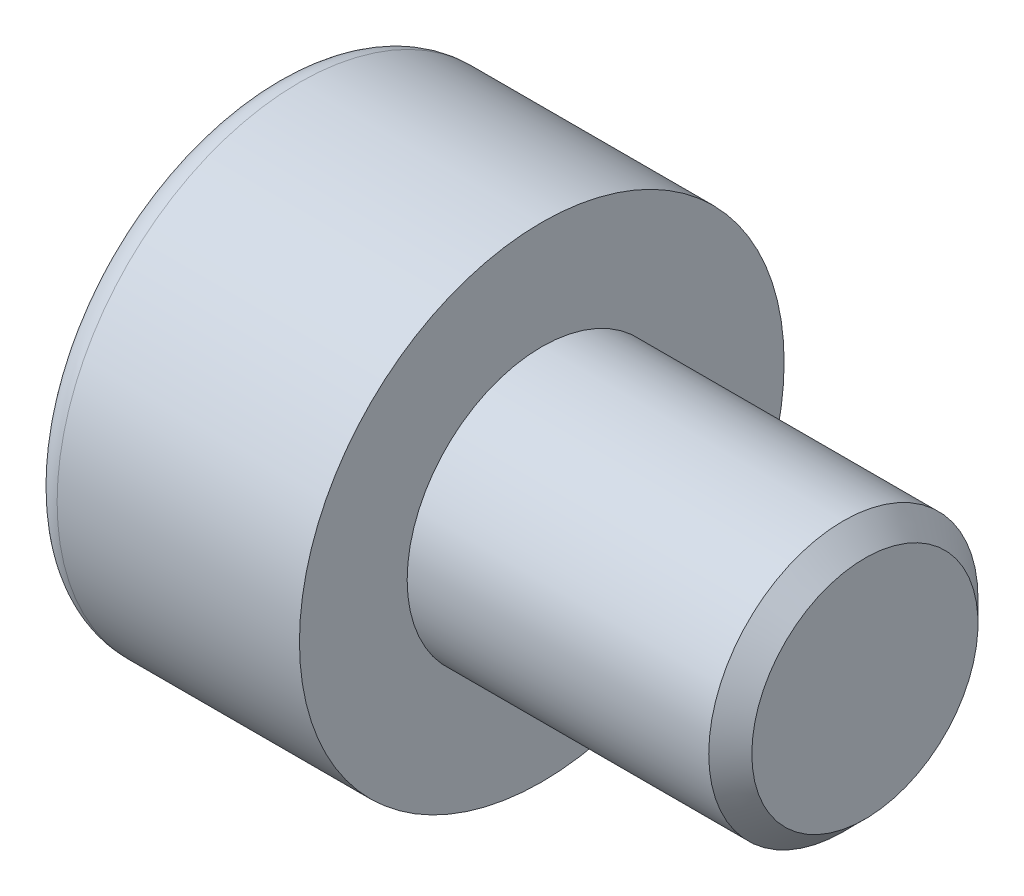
ISO-10303-21;
HEADER;
FILE_DESCRIPTION(('STEP AP214'),'2;1');
FILE_NAME('part.step','',(''),(''),'','','');
FILE_SCHEMA(('AUTOMOTIVE_DESIGN { 1 0 10303 214 1 1 1 1 }'));
ENDSEC;
DATA;
#1=APPLICATION_CONTEXT('core data for automotive mechanical design processes');
#2=APPLICATION_PROTOCOL_DEFINITION('international standard','automotive_design',2000,#1);
#3=PRODUCT_CONTEXT('',#1,'mechanical');
#4=PRODUCT('Part','Part','',(#3));
#5=PRODUCT_RELATED_PRODUCT_CATEGORY('part','',(#4));
#6=PRODUCT_DEFINITION_FORMATION('','',#4);
#7=PRODUCT_DEFINITION_CONTEXT('part definition',#1,'design');
#8=PRODUCT_DEFINITION('design','',#6,#7);
#9=PRODUCT_DEFINITION_SHAPE('','',#8);
#10=(LENGTH_UNIT() NAMED_UNIT(*) SI_UNIT(.MILLI.,.METRE.));
#11=(NAMED_UNIT(*) PLANE_ANGLE_UNIT() SI_UNIT($,.RADIAN.));
#12=(NAMED_UNIT(*) SI_UNIT($,.STERADIAN.) SOLID_ANGLE_UNIT());
#13=UNCERTAINTY_MEASURE_WITH_UNIT(LENGTH_MEASURE(1.E-05),#10,'distance_accuracy_value','');
#14=(GEOMETRIC_REPRESENTATION_CONTEXT(3) GLOBAL_UNCERTAINTY_ASSIGNED_CONTEXT((#13)) GLOBAL_UNIT_ASSIGNED_CONTEXT((#10,
#11,#12)) REPRESENTATION_CONTEXT('',''));
#15=CARTESIAN_POINT('',(0.,0.,0.));
#16=DIRECTION('',(0.,0.,1.));
#17=DIRECTION('',(1.,0.,0.));
#18=AXIS2_PLACEMENT_3D('',#15,#16,#17);
#19=CARTESIAN_POINT('',(-0.850000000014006,0.,0.));
#20=DIRECTION('',(-1.,0.,0.));
#21=DIRECTION('',(0.,0.,1.));
#22=AXIS2_PLACEMENT_3D('',#19,#20,#21);
#23=CONICAL_SURFACE('',#22,0.952380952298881,1.04719755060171);
#24=CARTESIAN_POINT('',(-0.300142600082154,-5.6843418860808E-11,0.));
#25=VERTEX_POINT('',#24);
#26=VERTEX_LOOP('',#25);
#27=FACE_BOUND('',#26,.T.);
#28=CARTESIAN_POINT('',(-0.850000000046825,0.,0.));
#29=DIRECTION('',(-1.,0.,0.));
#30=DIRECTION('',(0.,0.,1.));
#31=AXIS2_PLACEMENT_3D('',#28,#29,#30);
#32=CIRCLE('',#31,0.952380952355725);
#33=CARTESIAN_POINT('',(-0.850000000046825,0.,0.952380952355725));
#34=VERTEX_POINT('',#33);
#35=EDGE_CURVE('E22',#34,#34,#32,.T.);
#36=ORIENTED_EDGE('',*,*,#35,.T.);
#37=EDGE_LOOP('',(#36));
#38=FACE_BOUND('',#37,.T.);
#39=ADVANCED_FACE('F17',(#27,#38),#23,.F.);
#40=CARTESIAN_POINT('',(-0.85,0.,0.));
#41=DIRECTION('',(1.,0.,0.));
#42=DIRECTION('',(0.,0.,-1.));
#43=AXIS2_PLACEMENT_3D('',#40,#41,#42);
#44=PLANE('',#43);
#45=ORIENTED_EDGE('',*,*,#35,.F.);
#46=EDGE_LOOP('',(#45));
#47=FACE_BOUND('',#46,.T.);
#48=DIRECTION('',(0.,0.5,-0.866025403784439));
#49=VECTOR('',#48,1.);
#50=CARTESIAN_POINT('',(-0.85,-1.14892703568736,0.));
#51=LINE('',#50,#49);
#52=CARTESIAN_POINT('',(-0.85,-0.57446350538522,-0.995000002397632));
#53=VERTEX_POINT('',#52);
#54=CARTESIAN_POINT('',(-0.85,-1.14892703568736,0.));
#55=VERTEX_POINT('',#54);
#56=EDGE_CURVE('E313',#53,#55,#51,.F.);
#57=ORIENTED_EDGE('',*,*,#56,.T.);
#58=DIRECTION('',(0.,-0.5,-0.866025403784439));
#59=VECTOR('',#58,1.);
#60=CARTESIAN_POINT('',(-0.85,-0.574463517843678,0.995));
#61=LINE('',#60,#59);
#62=CARTESIAN_POINT('',(-0.85,-0.574463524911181,0.994999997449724));
#63=VERTEX_POINT('',#62);
#64=EDGE_CURVE('E317',#55,#63,#61,.F.);
#65=ORIENTED_EDGE('',*,*,#64,.T.);
#66=DIRECTION('',(0.,1.,0.));
#67=VECTOR('',#66,1.);
#68=CARTESIAN_POINT('',(-0.85,0.574463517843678,0.995));
#69=LINE('',#68,#67);
#70=CARTESIAN_POINT('',(-0.85,0.574463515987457,0.995000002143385));
#71=VERTEX_POINT('',#70);
#72=EDGE_CURVE('E84',#63,#71,#69,.T.);
#73=ORIENTED_EDGE('',*,*,#72,.T.);
#74=DIRECTION('',(0.,-0.5,0.866025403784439));
#75=VECTOR('',#74,1.);
#76=CARTESIAN_POINT('',(-0.85,1.14892703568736,0.));
#77=LINE('',#76,#75);
#78=CARTESIAN_POINT('',(-0.85,1.14892703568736,0.));
#79=VERTEX_POINT('',#78);
#80=EDGE_CURVE('E91',#71,#79,#77,.F.);
#81=ORIENTED_EDGE('',*,*,#80,.T.);
#82=DIRECTION('',(0.,0.5,0.866025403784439));
#83=VECTOR('',#82,1.);
#84=CARTESIAN_POINT('',(-0.85,0.574463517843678,-0.995));
#85=LINE('',#84,#83);
#86=CARTESIAN_POINT('',(-0.85,0.574463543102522,-0.994999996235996));
#87=VERTEX_POINT('',#86);
#88=EDGE_CURVE('E304',#79,#87,#85,.F.);
#89=ORIENTED_EDGE('',*,*,#88,.T.);
#90=DIRECTION('',(0.,1.,0.));
#91=VECTOR('',#90,1.);
#92=CARTESIAN_POINT('',(-0.85,-0.574463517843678,-0.995));
#93=LINE('',#92,#91);
#94=EDGE_CURVE('E279',#87,#53,#93,.F.);
#95=ORIENTED_EDGE('',*,*,#94,.T.);
#96=EDGE_LOOP('',(#57,#65,#73,#81,#89,#95));
#97=FACE_BOUND('',#96,.T.);
#98=ADVANCED_FACE('F148',(#47,#97),#44,.F.);
#99=CARTESIAN_POINT('',(-0.85,0.574463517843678,0.995));
#100=DIRECTION('',(0.,0.,1.));
#101=DIRECTION('',(1.,0.,0.));
#102=AXIS2_PLACEMENT_3D('',#99,#100,#101);
#103=PLANE('',#102);
#104=CARTESIAN_POINT('',(-2.34499999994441,0.,0.995));
#105=CARTESIAN_POINT('',(-2.3449743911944,-0.0305677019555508,0.995));
#106=CARTESIAN_POINT('',(-2.34640800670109,-0.0611198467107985,0.995));
#107=CARTESIAN_POINT('',(-2.35199243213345,-0.121922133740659,0.995));
#108=CARTESIAN_POINT('',(-2.3561383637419,-0.152172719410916,0.995));
#109=CARTESIAN_POINT('',(-2.3668659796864,-0.211759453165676,0.995));
#110=CARTESIAN_POINT('',(-2.37340998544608,-0.241102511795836,0.995));
#111=CARTESIAN_POINT('',(-2.38864217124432,-0.299229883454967,0.995));
#112=CARTESIAN_POINT('',(-2.39733102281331,-0.328014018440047,0.995));
#113=CARTESIAN_POINT('',(-2.41947932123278,-0.393688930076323,0.995));
#114=CARTESIAN_POINT('',(-2.43358464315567,-0.430359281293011,0.995));
#115=CARTESIAN_POINT('',(-2.46443795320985,-0.50302343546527,0.995));
#116=CARTESIAN_POINT('',(-2.48121157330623,-0.53900643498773,0.995));
#117=CARTESIAN_POINT('',(-2.49892704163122,-0.574463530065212,0.995));
#118=B_SPLINE_CURVE_WITH_KNOTS('',3,(#104,#105,#106,#107,#108,#109,#110,#111,#112,#113,#114,
#115,#116,#117),.UNSPECIFIED.,.F.,.F.,(4,2,2,2,2,2,4),(0.,0.0916446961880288,0.183125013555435,
0.273225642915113,0.36335451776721,0.481117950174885,0.600089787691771),.UNSPECIFIED.);
#119=CARTESIAN_POINT('',(-2.34499999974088,0.,0.994999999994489));
#120=VERTEX_POINT('',#119);
#121=CARTESIAN_POINT('',(-2.49892703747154,-0.574463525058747,0.994999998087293));
#122=VERTEX_POINT('',#121);
#123=EDGE_CURVE('E79',#120,#122,#118,.T.);
#124=ORIENTED_EDGE('',*,*,#123,.F.);
#125=CARTESIAN_POINT('',(-2.49892703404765,0.574463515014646,0.995));
#126=CARTESIAN_POINT('',(-2.47907510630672,0.534722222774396,0.995));
#127=CARTESIAN_POINT('',(-2.46039599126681,0.49430925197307,0.995));
#128=CARTESIAN_POINT('',(-2.42621425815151,0.411872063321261,0.995));
#129=CARTESIAN_POINT('',(-2.41073261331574,0.36983922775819,0.995));
#130=CARTESIAN_POINT('',(-2.38444123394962,0.285641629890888,0.995));
#131=CARTESIAN_POINT('',(-2.37350879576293,0.243516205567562,0.995));
#132=CARTESIAN_POINT('',(-2.35666503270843,0.15836168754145,0.995));
#133=CARTESIAN_POINT('',(-2.35073836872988,0.115335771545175,0.995));
#134=CARTESIAN_POINT('',(-2.34674431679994,0.0601561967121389,0.995));
#135=CARTESIAN_POINT('',(-2.34609249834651,0.048163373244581,0.995));
#136=CARTESIAN_POINT('',(-2.34521965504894,0.0241145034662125,0.995));
#137=CARTESIAN_POINT('',(-2.34500034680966,0.0120583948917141,0.995));
#138=CARTESIAN_POINT('',(-2.34499999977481,6.10102043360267E-13,0.995));
#139=B_SPLINE_CURVE_WITH_KNOTS('',3,(#125,#126,#127,#128,#129,#130,#131,#132,#133,#134,#135,
#136,#137,#138),.UNSPECIFIED.,.F.,.F.,(4,2,2,2,2,2,4),(0.,0.133369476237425,0.267587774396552,
0.397905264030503,0.527821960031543,0.563847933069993,0.600016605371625),.UNSPECIFIED.);
#140=CARTESIAN_POINT('',(-2.49892703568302,0.574463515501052,0.995000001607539));
#141=VERTEX_POINT('',#140);
#142=EDGE_CURVE('E72',#141,#120,#139,.T.);
#143=ORIENTED_EDGE('',*,*,#142,.F.);
#144=DIRECTION('',(1.,0.,0.));
#145=VECTOR('',#144,1.);
#146=CARTESIAN_POINT('',(-0.85,0.574463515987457,0.995000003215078));
#147=LINE('',#146,#145);
#148=EDGE_CURVE('E76',#141,#71,#147,.T.);
#149=ORIENTED_EDGE('',*,*,#148,.T.);
#150=ORIENTED_EDGE('',*,*,#72,.F.);
#151=DIRECTION('',(1.,0.,0.));
#152=VECTOR('',#151,1.);
#153=CARTESIAN_POINT('',(-0.85,-0.574463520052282,0.994999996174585));
#154=LINE('',#153,#152);
#155=EDGE_CURVE('E315',#63,#122,#154,.F.);
#156=ORIENTED_EDGE('',*,*,#155,.T.);
#157=EDGE_LOOP('',(#124,#143,#149,#150,#156));
#158=FACE_BOUND('',#157,.T.);
#159=ADVANCED_FACE('F74',(#158),#103,.F.);
#160=CARTESIAN_POINT('',(-0.85,-0.574463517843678,0.995));
#161=DIRECTION('',(0.,-0.866025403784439,0.5));
#162=DIRECTION('',(0.,-0.5,-0.866025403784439));
#163=AXIS2_PLACEMENT_3D('',#160,#161,#162);
#164=PLANE('',#163);
#165=CARTESIAN_POINT('',(-2.49913739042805,-1.14913733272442,-0.00036424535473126));
#166=CARTESIAN_POINT('',(-2.47938857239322,-1.12938020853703,0.0338560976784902));
#167=CARTESIAN_POINT('',(-2.46079873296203,-1.10929266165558,0.0686487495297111));
#168=CARTESIAN_POINT('',(-2.42675971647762,-1.0683313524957,0.13959581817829));
#169=CARTESIAN_POINT('',(-2.4113295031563,-1.04745368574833,0.175756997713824));
#170=CARTESIAN_POINT('',(-2.38489633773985,-1.00535430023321,0.248675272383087));
#171=CARTESIAN_POINT('',(-2.37382694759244,-0.98414331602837,0.285413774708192));
#172=CARTESIAN_POINT('',(-2.35677080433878,-0.94125421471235,0.35969987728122));
#173=CARTESIAN_POINT('',(-2.35077130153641,-0.91957741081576,0.397245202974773));
#174=CARTESIAN_POINT('',(-2.34536065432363,-0.8822249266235,0.461941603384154));
#175=CARTESIAN_POINT('',(-2.34455998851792,-0.866597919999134,0.489008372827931));
#176=CARTESIAN_POINT('',(-2.34590101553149,-0.835374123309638,0.543089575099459));
#177=CARTESIAN_POINT('',(-2.34804335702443,-0.819777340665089,0.570103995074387));
#178=CARTESIAN_POINT('',(-2.35874331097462,-0.773209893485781,0.650761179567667));
#179=CARTESIAN_POINT('',(-2.37157503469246,-0.742470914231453,0.704002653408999));
#180=CARTESIAN_POINT('',(-2.40253293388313,-0.688539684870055,0.797414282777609));
#181=CARTESIAN_POINT('',(-2.41903118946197,-0.66509374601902,0.838023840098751));
#182=CARTESIAN_POINT('',(-2.45619453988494,-0.619119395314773,0.91765375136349));
#183=CARTESIAN_POINT('',(-2.47684610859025,-0.596588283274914,0.956678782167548));
#184=CARTESIAN_POINT('',(-2.49892703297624,-0.574463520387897,0.994999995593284));
#185=B_SPLINE_CURVE_WITH_KNOTS('',3,(#165,#166,#167,#168,#169,#170,#171,#172,#173,#174,#175,
#176,#177,#178,#179,#180,#181,#182,#183,#184),.UNSPECIFIED.,.F.,.F.,(4,2,2,2,2,2,2,2,2,4),(0.,
0.132615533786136,0.266005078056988,0.397275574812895,0.528214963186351,0.621871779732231,
0.715549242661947,0.902956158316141,1.0518860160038,1.20033848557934),.UNSPECIFIED.);
#186=CARTESIAN_POINT('',(-2.49967441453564,-1.14925495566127,1.37088865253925E-05));
#187=VERTEX_POINT('',#186);
#188=EDGE_CURVE('E92',#187,#122,#185,.T.);
#189=ORIENTED_EDGE('',*,*,#188,.T.);
#190=ORIENTED_EDGE('',*,*,#155,.F.);
#191=ORIENTED_EDGE('',*,*,#64,.F.);
#192=DIRECTION('',(-1.,0.,0.));
#193=VECTOR('',#192,1.);
#194=CARTESIAN_POINT('',(-0.85,-1.14892703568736,0.));
#195=LINE('',#194,#193);
#196=EDGE_CURVE('E307',#55,#187,#195,.T.);
#197=ORIENTED_EDGE('',*,*,#196,.T.);
#198=EDGE_LOOP('',(#189,#190,#191,#197));
#199=FACE_BOUND('',#198,.T.);
#200=ADVANCED_FACE('F147',(#199),#164,.F.);
#201=CARTESIAN_POINT('',(-0.85,-1.14892703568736,0.));
#202=DIRECTION('',(0.,-0.866025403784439,-0.5));
#203=DIRECTION('',(0.,0.5,-0.866025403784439));
#204=AXIS2_PLACEMENT_3D('',#201,#202,#203);
#205=PLANE('',#204);
#206=CARTESIAN_POINT('',(-2.49892702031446,-0.574463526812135,-0.994999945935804));
#207=CARTESIAN_POINT('',(-2.47920125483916,-0.594208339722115,-0.960800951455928));
#208=CARTESIAN_POINT('',(-2.46063412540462,-0.614283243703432,-0.926030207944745));
#209=CARTESIAN_POINT('',(-2.42663854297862,-0.655218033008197,-0.855129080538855));
#210=CARTESIAN_POINT('',(-2.41122899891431,-0.676081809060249,-0.818991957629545));
#211=CARTESIAN_POINT('',(-2.38483285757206,-0.718152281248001,-0.746123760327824));
#212=CARTESIAN_POINT('',(-2.37377984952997,-0.739348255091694,-0.709411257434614));
#213=CARTESIAN_POINT('',(-2.35674986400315,-0.782206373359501,-0.635178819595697));
#214=CARTESIAN_POINT('',(-2.35076018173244,-0.803867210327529,-0.597661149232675));
#215=CARTESIAN_POINT('',(-2.34535763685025,-0.841202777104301,-0.532994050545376));
#216=CARTESIAN_POINT('',(-2.34455932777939,-0.856829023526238,-0.505928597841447));
#217=CARTESIAN_POINT('',(-2.34590474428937,-0.888051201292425,-0.451850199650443));
#218=CARTESIAN_POINT('',(-2.34804911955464,-0.903647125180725,-0.424837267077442));
#219=CARTESIAN_POINT('',(-2.35875462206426,-0.950212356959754,-0.344183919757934));
#220=CARTESIAN_POINT('',(-2.37158937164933,-0.980949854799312,-0.290945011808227));
#221=CARTESIAN_POINT('',(-2.40257169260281,-1.03491414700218,-0.197476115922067));
#222=CARTESIAN_POINT('',(-2.41909998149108,-1.0583933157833,-0.156809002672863));
#223=CARTESIAN_POINT('',(-2.45633304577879,-1.10443127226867,-0.0770689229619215));
#224=CARTESIAN_POINT('',(-2.47702419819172,-1.12699278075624,-0.0379912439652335));
#225=CARTESIAN_POINT('',(-2.49914689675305,-1.14914683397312,0.000380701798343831));
#226=B_SPLINE_CURVE_WITH_KNOTS('',3,(#206,#207,#208,#209,#210,#211,#212,#213,#214,#215,#216,
#217,#218,#219,#220,#221,#222,#223,#224,#225),.UNSPECIFIED.,.F.,.F.,(4,2,2,2,2,2,2,2,2,4),(0.,
0.132518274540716,0.265808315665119,0.396979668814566,0.527820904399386,0.621472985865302,
0.715145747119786,0.902546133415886,1.05169311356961,1.20035972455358),.UNSPECIFIED.);
#227=CARTESIAN_POINT('',(-2.49892702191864,-0.57446349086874,-0.995));
#228=VERTEX_POINT('',#227);
#229=EDGE_CURVE('E245',#228,#187,#226,.T.);
#230=ORIENTED_EDGE('',*,*,#229,.T.);
#231=ORIENTED_EDGE('',*,*,#196,.F.);
#232=ORIENTED_EDGE('',*,*,#56,.F.);
#233=DIRECTION('',(-1.,0.,0.));
#234=VECTOR('',#233,1.);
#235=CARTESIAN_POINT('',(-0.85,-0.5744635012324,-0.995));
#236=LINE('',#235,#234);
#237=EDGE_CURVE('E276',#53,#228,#236,.T.);
#238=ORIENTED_EDGE('',*,*,#237,.T.);
#239=EDGE_LOOP('',(#230,#231,#232,#238));
#240=FACE_BOUND('',#239,.T.);
#241=ADVANCED_FACE('F154',(#240),#205,.F.);
#242=CARTESIAN_POINT('',(-0.85,0.574463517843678,-0.995));
#243=DIRECTION('',(0.,0.866025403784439,-0.5));
#244=DIRECTION('',(0.,0.5,0.866025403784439));
#245=AXIS2_PLACEMENT_3D('',#242,#243,#244);
#246=PLANE('',#245);
#247=CARTESIAN_POINT('',(-2.49913349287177,1.14913343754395,0.000357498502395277));
#248=CARTESIAN_POINT('',(-2.47938510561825,1.12937654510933,-0.0338624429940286));
#249=CARTESIAN_POINT('',(-2.46079569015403,1.10928923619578,-0.0686546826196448));
#250=CARTESIAN_POINT('',(-2.42675748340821,1.06832842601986,-0.139600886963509));
#251=CARTESIAN_POINT('',(-2.41132765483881,1.04745102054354,-0.17576161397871));
#252=CARTESIAN_POINT('',(-2.38489517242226,1.00535217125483,-0.24867895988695));
#253=CARTESIAN_POINT('',(-2.37382608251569,0.984141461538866,-0.285416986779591));
#254=CARTESIAN_POINT('',(-2.35677041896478,0.941252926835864,-0.359702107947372));
#255=CARTESIAN_POINT('',(-2.35077109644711,0.919576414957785,-0.397246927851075));
#256=CARTESIAN_POINT('',(-2.34536059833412,0.882224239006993,-0.461942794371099));
#257=CARTESIAN_POINT('',(-2.34455997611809,0.866597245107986,-0.489009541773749));
#258=CARTESIAN_POINT('',(-2.34590108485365,0.835373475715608,-0.543090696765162));
#259=CARTESIAN_POINT('',(-2.34804346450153,0.819776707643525,-0.570105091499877));
#260=CARTESIAN_POINT('',(-2.35874352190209,0.7732093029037,-0.650762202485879));
#261=CARTESIAN_POINT('',(-2.37157530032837,0.742470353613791,-0.704003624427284));
#262=CARTESIAN_POINT('',(-2.40253322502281,0.688539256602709,-0.797415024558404));
#263=CARTESIAN_POINT('',(-2.41903143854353,0.665093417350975,-0.8380244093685));
#264=CARTESIAN_POINT('',(-2.45619466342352,0.619119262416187,-0.917653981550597));
#265=CARTESIAN_POINT('',(-2.47684614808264,0.596588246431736,-0.956678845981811));
#266=CARTESIAN_POINT('',(-2.49892697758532,0.574463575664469,-0.994999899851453));
#267=B_SPLINE_CURVE_WITH_KNOTS('',3,(#247,#248,#249,#250,#251,#252,#253,#254,#255,#256,#257,
#258,#259,#260,#261,#262,#263,#264,#265,#266),.UNSPECIFIED.,.F.,.F.,(4,2,2,2,2,2,2,2,2,4),(0.,
0.132613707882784,0.26600138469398,0.397270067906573,0.528207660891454,0.621864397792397,
0.715541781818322,0.902948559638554,1.05187781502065,1.20032966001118),.UNSPECIFIED.);
#268=CARTESIAN_POINT('',(-2.49967445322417,1.14925510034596,-2.50553599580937E-05));
#269=VERTEX_POINT('',#268);
#270=CARTESIAN_POINT('',(-2.49892701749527,0.574463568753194,-0.994999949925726));
#271=VERTEX_POINT('',#270);
#272=EDGE_CURVE('E250',#269,#271,#267,.T.);
#273=ORIENTED_EDGE('',*,*,#272,.T.);
#274=DIRECTION('',(-1.,0.,0.));
#275=VECTOR('',#274,1.);
#276=CARTESIAN_POINT('',(-0.85,0.574463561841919,-0.995));
#277=LINE('',#276,#275);
#278=EDGE_CURVE('E277',#271,#87,#277,.F.);
#279=ORIENTED_EDGE('',*,*,#278,.T.);
#280=ORIENTED_EDGE('',*,*,#88,.F.);
#281=DIRECTION('',(-1.,0.,0.));
#282=VECTOR('',#281,1.);
#283=CARTESIAN_POINT('',(-0.85,1.14892703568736,0.));
#284=LINE('',#283,#282);
#285=EDGE_CURVE('E93',#79,#269,#284,.T.);
#286=ORIENTED_EDGE('',*,*,#285,.T.);
#287=EDGE_LOOP('',(#273,#279,#280,#286));
#288=FACE_BOUND('',#287,.T.);
#289=ADVANCED_FACE('F263',(#288),#246,.F.);
#290=CARTESIAN_POINT('',(-0.85,-0.574463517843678,-0.995));
#291=DIRECTION('',(0.,0.,-1.));
#292=DIRECTION('',(-1.,0.,0.));
#293=AXIS2_PLACEMENT_3D('',#290,#291,#292);
#294=PLANE('',#293);
#295=CARTESIAN_POINT('',(-2.49892707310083,0.57446354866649,-0.994999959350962));
#296=CARTESIAN_POINT('',(-2.47920148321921,0.534974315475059,-0.994999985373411));
#297=CARTESIAN_POINT('',(-2.4606345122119,0.494824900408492,-0.994999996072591));
#298=CARTESIAN_POINT('',(-2.42663917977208,0.412956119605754,-0.995000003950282));
#299=CARTESIAN_POINT('',(-2.41122972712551,0.371228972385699,-0.995000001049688));
#300=CARTESIAN_POINT('',(-2.38483342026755,0.287088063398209,-0.994999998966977));
#301=CARTESIAN_POINT('',(-2.37378023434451,0.244695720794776,-0.994999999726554));
#302=CARTESIAN_POINT('',(-2.35674998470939,0.158978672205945,-0.995000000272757));
#303=CARTESIAN_POINT('',(-2.35076021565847,0.11565658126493,-0.995000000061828));
#304=CARTESIAN_POINT('',(-2.34535762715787,0.0409848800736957,-0.994999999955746));
#305=CARTESIAN_POINT('',(-2.34455932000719,0.00973223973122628,-0.99499999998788));
#306=CARTESIAN_POINT('',(-2.34590476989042,-0.0527124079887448,-0.995000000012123));
#307=CARTESIAN_POINT('',(-2.34804917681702,-0.0839044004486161,-0.995000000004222));
#308=CARTESIAN_POINT('',(-2.35875473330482,-0.17703472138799,-0.994999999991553));
#309=CARTESIAN_POINT('',(-2.37158942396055,-0.238509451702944,-0.994999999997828));
#310=CARTESIAN_POINT('',(-2.40254901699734,-0.346358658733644,-0.995000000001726));
#311=CARTESIAN_POINT('',(-2.41904542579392,-0.393240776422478,-0.995000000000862));
#312=CARTESIAN_POINT('',(-2.45620299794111,-0.48517024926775,-0.994999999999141));
#313=CARTESIAN_POINT('',(-2.47685060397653,-0.530223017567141,-0.994999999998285));
#314=CARTESIAN_POINT('',(-2.49892701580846,-0.574463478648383,-0.995));
#315=B_SPLINE_CURVE_WITH_KNOTS('',3,(#295,#296,#297,#298,#299,#300,#301,#302,#303,#304,#305,
#306,#307,#308,#309,#310,#311,#312,#313,#314),.UNSPECIFIED.,.F.,.F.,(4,2,2,2,2,2,2,2,2,4),(0.,
0.13251703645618,0.26580584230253,0.396978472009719,0.527820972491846,0.621473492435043,
0.71514669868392,0.902546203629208,1.05144676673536,1.19986871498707),.UNSPECIFIED.);
#316=EDGE_CURVE('E106',#271,#228,#315,.T.);
#317=ORIENTED_EDGE('',*,*,#316,.T.);
#318=ORIENTED_EDGE('',*,*,#237,.F.);
#319=ORIENTED_EDGE('',*,*,#94,.F.);
#320=ORIENTED_EDGE('',*,*,#278,.F.);
#321=EDGE_LOOP('',(#317,#318,#319,#320));
#322=FACE_BOUND('',#321,.T.);
#323=ADVANCED_FACE('F180',(#322),#294,.F.);
#324=CARTESIAN_POINT('',(-0.85,1.14892703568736,0.));
#325=DIRECTION('',(0.,0.866025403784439,0.5));
#326=DIRECTION('',(0.,-0.5,0.866025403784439));
#327=AXIS2_PLACEMENT_3D('',#324,#325,#326);
#328=PLANE('',#327);
#329=CARTESIAN_POINT('',(-2.49892703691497,0.574463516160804,0.995000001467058));
#330=CARTESIAN_POINT('',(-2.47920127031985,0.594208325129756,0.960800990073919));
#331=CARTESIAN_POINT('',(-2.46063413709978,0.61428323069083,0.926030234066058));
#332=CARTESIAN_POINT('',(-2.42663854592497,0.655218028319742,0.855129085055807));
#333=CARTESIAN_POINT('',(-2.41122899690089,0.676081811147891,0.818991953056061));
#334=CARTESIAN_POINT('',(-2.38483285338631,0.71815228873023,0.746123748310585));
#335=CARTESIAN_POINT('',(-2.37377984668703,0.739348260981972,0.709411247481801));
#336=CARTESIAN_POINT('',(-2.35674986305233,0.782206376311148,0.635178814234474));
#337=CARTESIAN_POINT('',(-2.35076018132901,0.803867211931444,0.597661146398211));
#338=CARTESIAN_POINT('',(-2.34535763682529,0.841202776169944,0.5329940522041));
#339=CARTESIAN_POINT('',(-2.34455932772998,0.856829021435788,0.50592860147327));
#340=CARTESIAN_POINT('',(-2.34590474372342,0.888051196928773,0.451850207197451));
#341=CARTESIAN_POINT('',(-2.3480491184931,0.903647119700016,0.424837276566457));
#342=CARTESIAN_POINT('',(-2.35875462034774,0.950212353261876,0.344183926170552));
#343=CARTESIAN_POINT('',(-2.37158937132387,0.98094985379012,0.290945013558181));
#344=CARTESIAN_POINT('',(-2.40257210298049,1.03491486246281,0.197474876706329));
#345=CARTESIAN_POINT('',(-2.41910096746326,1.05839471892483,0.156806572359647));
#346=CARTESIAN_POINT('',(-2.45633539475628,1.10443399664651,0.0770642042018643));
#347=CARTESIAN_POINT('',(-2.47702733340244,1.12699613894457,0.0379854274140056));
#348=CARTESIAN_POINT('',(-2.49915086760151,1.14915080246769,-0.000387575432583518));
#349=B_SPLINE_CURVE_WITH_KNOTS('',3,(#329,#330,#331,#332,#333,#334,#335,#336,#337,#338,#339,
#340,#341,#342,#343,#344,#345,#346,#347,#348),.UNSPECIFIED.,.F.,.F.,(4,2,2,2,2,2,2,2,2,4),(0.,
0.132518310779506,0.26580838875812,0.396979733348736,0.52782096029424,0.621473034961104,
0.715145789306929,0.90254619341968,1.05169762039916,1.20036864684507),.UNSPECIFIED.);
#350=EDGE_CURVE('E89',#141,#269,#349,.T.);
#351=ORIENTED_EDGE('',*,*,#350,.T.);
#352=ORIENTED_EDGE('',*,*,#285,.F.);
#353=ORIENTED_EDGE('',*,*,#80,.F.);
#354=ORIENTED_EDGE('',*,*,#148,.F.);
#355=EDGE_LOOP('',(#351,#352,#353,#354));
#356=FACE_BOUND('',#355,.T.);
#357=ADVANCED_FACE('F87',(#356),#328,.F.);
#358=CARTESIAN_POINT('',(2.99999999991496,1.5462594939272,0.));
#359=DIRECTION('',(1.,0.,0.));
#360=DIRECTION('',(0.,0.,-1.));
#361=AXIS2_PLACEMENT_3D('',#358,#359,#360);
#362=PLANE('',#361);
#363=CARTESIAN_POINT('',(2.99999999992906,0.,0.));
#364=DIRECTION('',(-1.,0.,0.));
#365=DIRECTION('',(0.,0.,1.));
#366=AXIS2_PLACEMENT_3D('',#363,#364,#365);
#367=CIRCLE('',#366,1.05000000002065);
#368=CARTESIAN_POINT('',(2.99999999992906,0.,1.05000000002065));
#369=VERTEX_POINT('',#368);
#370=EDGE_CURVE('E100',#369,#369,#367,.T.);
#371=ORIENTED_EDGE('',*,*,#370,.F.);
#372=EDGE_LOOP('',(#371));
#373=FACE_BOUND('',#372,.T.);
#374=ADVANCED_FACE('F170',(#373),#362,.T.);
#375=CARTESIAN_POINT('',(-2.50093213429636,0.,0.));
#376=DIRECTION('',(-1.,0.,0.));
#377=DIRECTION('',(0.,0.,1.));
#378=AXIS2_PLACEMENT_3D('',#375,#376,#377);
#379=CONICAL_SURFACE('',#378,1.15093213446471,0.785398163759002);
#380=CARTESIAN_POINT('',(-2.5,0.,0.));
#381=DIRECTION('',(-1.,0.,0.));
#382=DIRECTION('',(0.,0.,1.));
#383=AXIS2_PLACEMENT_3D('',#380,#381,#382);
#384=CIRCLE('',#383,1.15000000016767);
#385=CARTESIAN_POINT('',(-2.49999999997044,0.,1.15000000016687));
#386=VERTEX_POINT('',#385);
#387=EDGE_CURVE('E104',#386,#187,#384,.F.);
#388=ORIENTED_EDGE('',*,*,#387,.F.);
#389=DIRECTION('',(0.707106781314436,0.,-0.707106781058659));
#390=VECTOR('',#389,1.);
#391=CARTESIAN_POINT('',(-499000.,0.,498998.649819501));
#392=LINE('',#391,#390);
#393=EDGE_CURVE('E101',#386,#120,#392,.T.);
#394=ORIENTED_EDGE('',*,*,#393,.T.);
#395=ORIENTED_EDGE('',*,*,#123,.T.);
#396=ORIENTED_EDGE('',*,*,#188,.F.);
#397=EDGE_LOOP('',(#388,#394,#395,#396));
#398=FACE_BOUND('',#397,.T.);
#399=ADVANCED_FACE('F167',(#398),#379,.F.);
#400=CARTESIAN_POINT('',(-2.49946299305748,0.,0.));
#401=DIRECTION('',(-1.,0.,0.));
#402=DIRECTION('',(0.,0.,1.));
#403=AXIS2_PLACEMENT_3D('',#400,#401,#402);
#404=CONICAL_SURFACE('',#403,1.14946299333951,0.785398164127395);
#405=ORIENTED_EDGE('',*,*,#272,.F.);
#406=CARTESIAN_POINT('',(-2.5,0.,0.));
#407=DIRECTION('',(-1.,0.,0.));
#408=DIRECTION('',(0.,0.,1.));
#409=AXIS2_PLACEMENT_3D('',#406,#407,#408);
#410=CIRCLE('',#409,1.15000000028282);
#411=EDGE_CURVE('E229',#187,#269,#410,.F.);
#412=ORIENTED_EDGE('',*,*,#411,.F.);
#413=ORIENTED_EDGE('',*,*,#229,.F.);
#414=ORIENTED_EDGE('',*,*,#316,.F.);
#415=EDGE_LOOP('',(#405,#412,#413,#414));
#416=FACE_BOUND('',#415,.T.);
#417=ADVANCED_FACE('F129',(#416),#404,.F.);
#418=CARTESIAN_POINT('',(-2.5009317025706,0.,0.));
#419=DIRECTION('',(-1.,0.,0.));
#420=DIRECTION('',(0.,0.,1.));
#421=AXIS2_PLACEMENT_3D('',#418,#419,#420);
#422=CONICAL_SURFACE('',#421,1.15093170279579,0.785398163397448);
#423=ORIENTED_EDGE('',*,*,#350,.F.);
#424=ORIENTED_EDGE('',*,*,#142,.T.);
#425=ORIENTED_EDGE('',*,*,#393,.F.);
#426=CARTESIAN_POINT('',(-2.5,0.,0.));
#427=DIRECTION('',(-1.,0.,0.));
#428=DIRECTION('',(0.,0.,1.));
#429=AXIS2_PLACEMENT_3D('',#426,#427,#428);
#430=CIRCLE('',#429,1.15000000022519);
#431=EDGE_CURVE('E98',#269,#386,#430,.F.);
#432=ORIENTED_EDGE('',*,*,#431,.F.);
#433=EDGE_LOOP('',(#423,#424,#425,#432));
#434=FACE_BOUND('',#433,.T.);
#435=ADVANCED_FACE('F96',(#434),#422,.F.);
#436=CARTESIAN_POINT('',(2.79999999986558,0.,0.));
#437=DIRECTION('',(-1.,0.,0.));
#438=DIRECTION('',(0.,0.,1.));
#439=AXIS2_PLACEMENT_3D('',#436,#437,#438);
#440=CONICAL_SURFACE('',#439,1.25000000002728,0.78539816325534);
#441=ORIENTED_EDGE('',*,*,#370,.T.);
#442=EDGE_LOOP('',(#441));
#443=FACE_BOUND('',#442,.T.);
#444=CARTESIAN_POINT('',(2.79999999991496,0.,0.));
#445=DIRECTION('',(1.,0.,0.));
#446=DIRECTION('',(0.,0.,-1.));
#447=AXIS2_PLACEMENT_3D('',#444,#445,#446);
#448=CIRCLE('',#447,1.25);
#449=CARTESIAN_POINT('',(2.79999999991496,0.,-1.25));
#450=VERTEX_POINT('',#449);
#451=EDGE_CURVE('E201',#450,#450,#448,.F.);
#452=ORIENTED_EDGE('',*,*,#451,.F.);
#453=EDGE_LOOP('',(#452));
#454=FACE_BOUND('',#453,.T.);
#455=ADVANCED_FACE('F128',(#443,#454),#440,.T.);
#456=CARTESIAN_POINT('',(-2.5,1.575,0.));
#457=DIRECTION('',(-1.,0.,0.));
#458=DIRECTION('',(0.,0.,1.));
#459=AXIS2_PLACEMENT_3D('',#456,#457,#458);
#460=PLANE('',#459);
#461=ORIENTED_EDGE('',*,*,#411,.T.);
#462=ORIENTED_EDGE('',*,*,#431,.T.);
#463=ORIENTED_EDGE('',*,*,#387,.T.);
#464=EDGE_LOOP('',(#461,#462,#463));
#465=FACE_BOUND('',#464,.T.);
#466=CARTESIAN_POINT('',(-2.5,0.,1.99999999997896));
#467=CARTESIAN_POINT('',(-2.50000000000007,-0.0213602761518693,1.99999441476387));
#468=CARTESIAN_POINT('',(-2.49999999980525,-0.0427203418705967,1.99964659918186));
#469=CARTESIAN_POINT('',(-2.49999999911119,-0.0850058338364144,1.99828072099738));
#470=CARTESIAN_POINT('',(-2.4999999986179,-0.105931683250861,1.99727573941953));
#471=CARTESIAN_POINT('',(-2.49999999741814,-0.14732977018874,1.99463547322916));
#472=CARTESIAN_POINT('',(-2.49999999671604,-0.16780282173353,1.99301299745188));
#473=CARTESIAN_POINT('',(-2.49999999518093,-0.208277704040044,1.98917779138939));
#474=CARTESIAN_POINT('',(-2.49999999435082,-0.228280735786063,1.98697757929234));
#475=CARTESIAN_POINT('',(-2.49999999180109,-0.2869478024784,1.97962724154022));
#476=CARTESIAN_POINT('',(-2.49999998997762,-0.325511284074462,1.97364625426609));
#477=CARTESIAN_POINT('',(-2.49999998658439,-0.400597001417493,1.95974219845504));
#478=CARTESIAN_POINT('',(-2.49999998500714,-0.437136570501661,1.95191200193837));
#479=CARTESIAN_POINT('',(-2.49999998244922,-0.508117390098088,1.93461016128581));
#480=CARTESIAN_POINT('',(-2.49999998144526,-0.542580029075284,1.92522630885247));
#481=CARTESIAN_POINT('',(-2.49999998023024,-0.609373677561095,1.90510517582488));
#482=CARTESIAN_POINT('',(-2.49999997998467,-0.641729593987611,1.89445048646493));
#483=CARTESIAN_POINT('',(-2.49999998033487,-0.70430210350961,1.87206087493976));
#484=CARTESIAN_POINT('',(-2.49999998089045,-0.734546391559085,1.86040330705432));
#485=CARTESIAN_POINT('',(-2.49999998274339,-0.792908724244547,1.83626519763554));
#486=CARTESIAN_POINT('',(-2.49999998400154,-0.821056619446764,1.82385678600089));
#487=CARTESIAN_POINT('',(-2.49999998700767,-0.875257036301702,1.79845747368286));
#488=CARTESIAN_POINT('',(-2.49999998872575,-0.901340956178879,1.78553353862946));
#489=CARTESIAN_POINT('',(-2.49999999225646,-0.951458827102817,1.75932646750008));
#490=CARTESIAN_POINT('',(-2.49999999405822,-0.97552516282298,1.74610523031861));
#491=CARTESIAN_POINT('',(-2.49999999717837,-1.02166493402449,1.71950950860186));
#492=CARTESIAN_POINT('',(-2.4999999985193,-1.04377121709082,1.70619198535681));
#493=CARTESIAN_POINT('',(-2.50000000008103,-1.08605666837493,1.67959251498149));
#494=CARTESIAN_POINT('',(-2.50000000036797,-1.10626867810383,1.66636274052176));
#495=CARTESIAN_POINT('',(-2.49999999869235,-1.14483826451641,1.64011061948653));
#496=CARTESIAN_POINT('',(-2.49999999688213,-1.16322820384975,1.62713583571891));
#497=CARTESIAN_POINT('',(-2.49999999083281,-1.19822860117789,1.60154977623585));
#498=CARTESIAN_POINT('',(-2.49999998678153,-1.2148706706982,1.58898159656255));
#499=CARTESIAN_POINT('',(-2.49999996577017,-1.26029768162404,1.55355457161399));
#500=CARTESIAN_POINT('',(-2.49999994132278,-1.28866620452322,1.53015601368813));
#501=CARTESIAN_POINT('',(-2.49999989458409,-1.32996111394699,1.49414084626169));
#502=CARTESIAN_POINT('',(-2.49999987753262,-1.34339577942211,1.48210030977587));
#503=CARTESIAN_POINT('',(-2.49999980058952,-1.36836778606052,1.45913822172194));
#504=CARTESIAN_POINT('',(-2.49999974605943,-1.37994004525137,1.44825484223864));
#505=CARTESIAN_POINT('',(-2.49999972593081,-1.3944580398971,1.43421990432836));
#506=CARTESIAN_POINT('',(-2.49999972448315,-1.39754467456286,1.43121361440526));
#507=CARTESIAN_POINT('',(-2.49999972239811,-1.40784842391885,1.42111055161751));
#508=CARTESIAN_POINT('',(-2.49999972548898,-1.41501988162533,1.41396715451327));
#509=CARTESIAN_POINT('',(-2.49999973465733,-1.43560517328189,1.39314830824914));
#510=CARTESIAN_POINT('',(-2.49999974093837,-1.44887796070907,1.37933302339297));
#511=CARTESIAN_POINT('',(-2.49999975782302,-1.4804187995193,1.34554263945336));
#512=CARTESIAN_POINT('',(-2.49999976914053,-1.49848605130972,1.32537992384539));
#513=CARTESIAN_POINT('',(-2.49999979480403,-1.53894678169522,1.2783380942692));
#514=CARTESIAN_POINT('',(-2.49999980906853,-1.5610615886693,1.25121811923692));
#515=CARTESIAN_POINT('',(-2.49999983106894,-1.594955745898,1.20735154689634));
#516=CARTESIAN_POINT('',(-2.49999983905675,-1.60721444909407,1.19097245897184));
#517=CARTESIAN_POINT('',(-2.49999985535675,-1.63238460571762,1.15624388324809));
#518=CARTESIAN_POINT('',(-2.49999986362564,-1.64524459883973,1.13785698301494));
#519=CARTESIAN_POINT('',(-2.49999987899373,-1.66942628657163,1.10201320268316));
#520=CARTESIAN_POINT('',(-2.49999988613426,-1.6807918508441,1.08458586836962));
#521=CARTESIAN_POINT('',(-2.49999990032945,-1.70374837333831,1.04815569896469));
#522=CARTESIAN_POINT('',(-2.4999999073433,-1.71529964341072,1.02912783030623));
#523=CARTESIAN_POINT('',(-2.49999992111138,-1.73849367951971,0.989442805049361));
#524=CARTESIAN_POINT('',(-2.4999999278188,-1.75009320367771,0.968760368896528));
#525=CARTESIAN_POINT('',(-2.49999994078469,-1.77323752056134,0.925716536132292));
#526=CARTESIAN_POINT('',(-2.49999994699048,-1.78473541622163,0.903329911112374));
#527=CARTESIAN_POINT('',(-2.49999995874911,-1.80751745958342,0.856834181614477));
#528=CARTESIAN_POINT('',(-2.49999996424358,-1.81875095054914,0.83270024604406));
#529=CARTESIAN_POINT('',(-2.49999997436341,-1.84083232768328,0.782674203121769));
#530=CARTESIAN_POINT('',(-2.49999997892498,-1.85162571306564,0.756758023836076));
#531=CARTESIAN_POINT('',(-2.49999998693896,-1.87264222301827,0.703142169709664));
#532=CARTESIAN_POINT('',(-2.49999999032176,-1.88280693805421,0.675419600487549));
#533=CARTESIAN_POINT('',(-2.49999999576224,-1.90236886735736,0.618176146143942));
#534=CARTESIAN_POINT('',(-2.49999999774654,-1.91170372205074,0.588633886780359));
#535=CARTESIAN_POINT('',(-2.49999999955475,-1.92586685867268,0.539902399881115));
#536=CARTESIAN_POINT('',(-2.49999999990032,-1.93110440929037,0.520830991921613));
#537=CARTESIAN_POINT('',(-2.50000000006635,-1.94114075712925,0.482046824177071));
#538=CARTESIAN_POINT('',(-2.49999999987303,-1.94592473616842,0.462330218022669));
#539=CARTESIAN_POINT('',(-2.49999999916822,-1.95500432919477,0.422262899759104));
#540=CARTESIAN_POINT('',(-2.49999999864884,-1.95928462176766,0.401908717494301));
#541=CARTESIAN_POINT('',(-2.49999999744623,-1.96730651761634,0.360575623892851));
#542=CARTESIAN_POINT('',(-2.49999999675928,-1.97103231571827,0.339593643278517));
#543=CARTESIAN_POINT('',(-2.49999999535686,-1.97789366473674,0.297017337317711));
#544=CARTESIAN_POINT('',(-2.49999999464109,-1.98101293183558,0.275420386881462));
#545=CARTESIAN_POINT('',(-2.49999999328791,-1.98660873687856,0.231629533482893));
#546=CARTESIAN_POINT('',(-2.49999999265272,-1.98906852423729,0.209433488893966));
#547=CARTESIAN_POINT('',(-2.49999999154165,-1.99329206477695,0.164463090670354));
#548=CARTESIAN_POINT('',(-2.49999999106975,-1.99503861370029,0.141687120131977));
#549=CARTESIAN_POINT('',(-2.49999999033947,-1.99778173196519,0.0955789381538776));
#550=CARTESIAN_POINT('',(-2.49999999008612,-1.99876065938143,0.0722456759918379));
#551=CARTESIAN_POINT('',(-2.49999998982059,-1.99991413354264,0.0250485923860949));
#552=CARTESIAN_POINT('',(-2.49999998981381,-2.00007061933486,0.00118432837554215));
#553=CARTESIAN_POINT('',(-2.4999999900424,-1.99952456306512,-0.0470452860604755));
#554=CARTESIAN_POINT('',(-2.49999999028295,-1.99880356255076,-0.0714104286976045));
#555=CARTESIAN_POINT('',(-2.4999999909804,-1.99644786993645,-0.120608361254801));
#556=CARTESIAN_POINT('',(-2.49999999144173,-1.99479434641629,-0.145440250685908));
#557=CARTESIAN_POINT('',(-2.49999999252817,-1.9905191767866,-0.195534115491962));
#558=CARTESIAN_POINT('',(-2.49999999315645,-1.98787835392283,-0.220794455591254));
#559=CARTESIAN_POINT('',(-2.49999999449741,-1.98157466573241,-0.271703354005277));
#560=CARTESIAN_POINT('',(-2.49999999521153,-1.97789230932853,-0.297349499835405));
#561=CARTESIAN_POINT('',(-2.49999999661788,-1.96945241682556,-0.348983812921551));
#562=CARTESIAN_POINT('',(-2.49999999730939,-1.96467510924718,-0.374968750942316));
#563=CARTESIAN_POINT('',(-2.49999999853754,-1.95399336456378,-0.427229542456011));
#564=CARTESIAN_POINT('',(-2.49999999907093,-1.94806891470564,-0.45350130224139));
#565=CARTESIAN_POINT('',(-2.49999999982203,-1.93504212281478,-0.506281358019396));
#566=CARTESIAN_POINT('',(-2.50000000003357,-1.92791956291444,-0.532784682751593));
#567=CARTESIAN_POINT('',(-2.49999999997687,-1.91650912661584,-0.572006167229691));
#568=CARTESIAN_POINT('',(-2.49999999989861,-1.91263339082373,-0.584845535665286));
#569=CARTESIAN_POINT('',(-2.4999999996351,-1.90462430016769,-0.610443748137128));
#570=CARTESIAN_POINT('',(-2.49999999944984,-1.90049094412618,-0.623202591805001));
#571=CARTESIAN_POINT('',(-2.49999999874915,-1.88770700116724,-0.661350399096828));
#572=CARTESIAN_POINT('',(-2.4999999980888,-1.8786722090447,-0.686611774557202));
#573=CARTESIAN_POINT('',(-2.49999999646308,-1.85959364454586,-0.736750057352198));
#574=CARTESIAN_POINT('',(-2.49999999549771,-1.8495498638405,-0.761626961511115));
#575=CARTESIAN_POINT('',(-2.4999999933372,-1.82846945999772,-0.810956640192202));
#576=CARTESIAN_POINT('',(-2.49999999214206,-1.81743282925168,-0.835409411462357));
#577=CARTESIAN_POINT('',(-2.49999998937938,-1.79246361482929,-0.887888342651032));
#578=CARTESIAN_POINT('',(-2.49999998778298,-1.77835493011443,-0.915830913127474));
#579=CARTESIAN_POINT('',(-2.4999999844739,-1.7488415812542,-0.971022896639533));
#580=CARTESIAN_POINT('',(-2.49999998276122,-1.73343690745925,-0.998272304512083));
#581=CARTESIAN_POINT('',(-2.49999997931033,-1.70136535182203,-1.0520182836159));
#582=CARTESIAN_POINT('',(-2.49999997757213,-1.68469846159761,-1.07851484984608));
#583=CARTESIAN_POINT('',(-2.49999997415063,-1.65013925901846,-1.1306965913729));
#584=CARTESIAN_POINT('',(-2.49999997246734,-1.63224693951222,-1.15638176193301));
#585=CARTESIAN_POINT('',(-2.49999996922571,-1.59527630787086,-1.20688409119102));
#586=CARTESIAN_POINT('',(-2.49999996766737,-1.57619798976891,-1.2317012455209));
#587=CARTESIAN_POINT('',(-2.49999996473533,-1.53689742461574,-1.28041279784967));
#588=CARTESIAN_POINT('',(-2.49999996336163,-1.51667517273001,-1.30430719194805));
#589=CARTESIAN_POINT('',(-2.49999996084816,-1.47513132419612,-1.3511205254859));
#590=CARTESIAN_POINT('',(-2.49999995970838,-1.45380972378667,-1.37403946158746));
#591=CARTESIAN_POINT('',(-2.4999999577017,-1.41011419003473,-1.41885133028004));
#592=CARTESIAN_POINT('',(-2.49999995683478,-1.38774025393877,-1.44074426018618));
#593=CARTESIAN_POINT('',(-2.49999995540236,-1.34198938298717,-1.48345583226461));
#594=CARTESIAN_POINT('',(-2.49999995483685,-1.31861244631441,-1.50427447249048));
#595=CARTESIAN_POINT('',(-2.49999995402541,-1.27090712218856,-1.54479155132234));
#596=CARTESIAN_POINT('',(-2.49999995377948,-1.24657873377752,-1.56448998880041));
#597=CARTESIAN_POINT('',(-2.499999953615,-1.19702415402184,-1.60272322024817));
#598=CARTESIAN_POINT('',(-2.49999995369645,-1.17179796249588,-1.62125801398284));
#599=CARTESIAN_POINT('',(-2.49999995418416,-1.12050340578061,-1.65712308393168));
#600=CARTESIAN_POINT('',(-2.49999995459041,-1.0944350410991,-1.67445336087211));
#601=CARTESIAN_POINT('',(-2.49999995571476,-1.04151362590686,-1.7078711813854));
#602=CARTESIAN_POINT('',(-2.49999995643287,-1.01466057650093,-1.72395872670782));
#603=CARTESIAN_POINT('',(-2.4999999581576,-0.960229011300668,-1.7548556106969));
#604=CARTESIAN_POINT('',(-2.49999995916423,-0.932650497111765,-1.76966495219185));
#605=CARTESIAN_POINT('',(-2.49999996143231,-0.876828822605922,-1.79797277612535));
#606=CARTESIAN_POINT('',(-2.49999996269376,-0.848585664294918,-1.81147126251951));
#607=CARTESIAN_POINT('',(-2.49999996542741,-0.791496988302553,-1.83712761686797));
#608=CARTESIAN_POINT('',(-2.49999996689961,-0.76265147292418,-1.84928548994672));
#609=CARTESIAN_POINT('',(-2.49999997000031,-0.70442169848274,-1.87223381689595));
#610=CARTESIAN_POINT('',(-2.4999999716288,-0.67503744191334,-1.88302427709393));
#611=CARTESIAN_POINT('',(-2.49999997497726,-0.615794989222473,-1.90321399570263));
#612=CARTESIAN_POINT('',(-2.49999997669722,-0.585936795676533,-1.91261326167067));
#613=CARTESIAN_POINT('',(-2.49999998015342,-0.52581231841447,-1.92999987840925));
#614=CARTESIAN_POINT('',(-2.49999998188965,-0.495546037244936,-1.93798723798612));
#615=CARTESIAN_POINT('',(-2.4999999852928,-0.434672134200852,-1.95253244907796));
#616=CARTESIAN_POINT('',(-2.49999998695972,-0.404064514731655,-1.95909031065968));
#617=CARTESIAN_POINT('',(-2.49999999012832,-0.34257543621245,-1.97076207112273));
#618=CARTESIAN_POINT('',(-2.49999999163,-0.311693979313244,-1.97587598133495));
#619=CARTESIAN_POINT('',(-2.49999999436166,-0.249725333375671,-1.98464863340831));
#620=CARTESIAN_POINT('',(-2.49999999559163,-0.218638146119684,-1.98830738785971));
#621=CARTESIAN_POINT('',(-2.49999999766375,-0.156326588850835,-1.99416150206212));
#622=CARTESIAN_POINT('',(-2.4999999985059,-0.125102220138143,-1.99635687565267));
#623=CARTESIAN_POINT('',(-2.49999999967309,-0.0625851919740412,-1.99928009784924));
#624=CARTESIAN_POINT('',(-2.49999999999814,-0.0312925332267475,-2.0000079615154));
#625=CARTESIAN_POINT('',(-2.5,0.,-1.99999999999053));
#626=B_SPLINE_CURVE_WITH_KNOTS('',3,(#466,#467,#468,#469,#470,#471,#472,#473,#474,#475,#476,
#477,#478,#479,#480,#481,#482,#483,#484,#485,#486,#487,#488,#489,#490,#491,#492,#493,#494,#495,
#496,#497,#498,#499,#500,#501,#502,#503,#504,#505,#506,#507,#508,#509,#510,#511,#512,#513,#514,
#515,#516,#517,#518,#519,#520,#521,#522,#523,#524,#525,#526,#527,#528,#529,#530,#531,#532,#533,
#534,#535,#536,#537,#538,#539,#540,#541,#542,#543,#544,#545,#546,#547,#548,#549,#550,#551,#552,
#553,#554,#555,#556,#557,#558,#559,#560,#561,#562,#563,#564,#565,#566,#567,#568,#569,#570,#571,
#572,#573,#574,#575,#576,#577,#578,#579,#580,#581,#582,#583,#584,#585,#586,#587,#588,#589,#590,
#591,#592,#593,#594,#595,#596,#597,#598,#599,#600,#601,#602,#603,#604,#605,#606,#607,#608,#609,
#610,#611,#612,#613,#614,#615,#616,#617,#618,#619,#620,#621,#622,#623,#624,#625),.UNSPECIFIED.,
.F.,.F.,(4,2,2,2,2,2,2,2,2,2,2,2,2,2,2,2,2,2,2,2,2,2,2,2,2,2,2,2,2,2,2,2,2,2,2,2,2,2,2,2,2,2,2,
2,2,2,2,2,2,2,2,2,2,2,2,2,2,2,2,2,2,2,2,2,2,2,2,2,2,2,2,2,2,2,2,2,2,2,2,4),(0.,
0.0640778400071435,0.126917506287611,0.188519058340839,0.248882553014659,0.365883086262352,
0.477933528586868,0.585034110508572,0.687185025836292,0.784386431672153,0.876638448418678,
0.963941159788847,1.0462946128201,1.1236988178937,1.19615374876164,1.26365934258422,
1.32621549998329,1.43646862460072,1.4905863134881,1.53823851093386,1.55116460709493,
1.5815298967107,1.63899573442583,1.72019416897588,1.82512136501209,1.88648887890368,
1.95378889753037,2.01619704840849,2.08296344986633,2.15408785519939,2.22957000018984,
2.30940960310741,2.39360636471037,2.48215996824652,2.57507007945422,2.63439494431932,
2.69525139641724,2.75763947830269,2.82155923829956,2.88701073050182,2.95399401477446,
3.02250915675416,3.09255622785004,3.16413530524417,3.23724647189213,3.31188981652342,
3.38806543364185,3.46577342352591,3.54501389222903,3.62578695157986,3.70809271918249,
3.74832517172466,3.78855780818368,3.86901953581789,3.94948192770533,4.02994493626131,
4.12381687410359,4.21768951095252,4.31156277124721,4.4054365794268,4.4993108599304,
4.59318553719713,4.68706053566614,4.78093577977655,4.8748111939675,4.96868670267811,
5.06256223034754,5.15643770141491,5.25031304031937,5.34418817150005,5.43806301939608,
5.53193750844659,5.62581156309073,5.7196851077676,5.81355806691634,5.90743036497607,
6.00130192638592,6.09517267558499,6.18904253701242,6.28291143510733),.UNSPECIFIED.);
#627=CARTESIAN_POINT('',(-2.5,-1.1830350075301E-07,1.99999999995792));
#628=VERTEX_POINT('',#627);
#629=CARTESIAN_POINT('',(-2.5,-9.4650337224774E-08,-2.00000000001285));
#630=VERTEX_POINT('',#629);
#631=EDGE_CURVE('E37',#628,#630,#626,.T.);
#632=ORIENTED_EDGE('',*,*,#631,.F.);
#633=CARTESIAN_POINT('',(-2.5,2.,0.));
#634=CARTESIAN_POINT('',(-2.49999997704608,2.00000503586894,0.0359554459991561));
#635=CARTESIAN_POINT('',(-2.49999999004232,1.99903171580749,0.0719036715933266));
#636=CARTESIAN_POINT('',(-2.50000000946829,1.99517573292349,0.143697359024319));
#637=CARTESIAN_POINT('',(-2.50000001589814,1.99229310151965,0.179542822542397));
#638=CARTESIAN_POINT('',(-2.49999993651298,1.98390324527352,0.258192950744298));
#639=CARTESIAN_POINT('',(-2.49999983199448,1.97798644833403,0.300955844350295));
#640=CARTESIAN_POINT('',(-2.49999980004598,1.96879127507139,0.35389649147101));
#641=CARTESIAN_POINT('',(-2.4999997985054,1.96688935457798,0.364321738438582));
#642=CARTESIAN_POINT('',(-2.49999980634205,1.95924552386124,0.404358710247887));
#643=CARTESIAN_POINT('',(-2.49999984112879,1.9528972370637,0.43385608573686));
#644=CARTESIAN_POINT('',(-2.49999991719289,1.93450389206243,0.510816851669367));
#645=CARTESIAN_POINT('',(-2.49999994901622,1.92137345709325,0.558026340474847));
#646=CARTESIAN_POINT('',(-2.49999998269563,1.89899081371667,0.628356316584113));
#647=CARTESIAN_POINT('',(-2.49999999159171,1.89101291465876,0.651891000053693));
#648=CARTESIAN_POINT('',(-2.50000000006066,1.87477366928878,0.697028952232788));
#649=CARTESIAN_POINT('',(-2.50000000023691,1.86657028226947,0.718653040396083));
#650=CARTESIAN_POINT('',(-2.4999999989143,1.84371523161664,0.77592385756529));
#651=CARTESIAN_POINT('',(-2.49999999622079,1.82840965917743,0.811311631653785));
#652=CARTESIAN_POINT('',(-2.49999999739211,1.79580287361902,0.881155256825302));
#653=CARTESIAN_POINT('',(-2.50000000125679,1.77850170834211,0.915611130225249));
#654=CARTESIAN_POINT('',(-2.49999999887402,1.75109851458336,0.966508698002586));
#655=CARTESIAN_POINT('',(-2.49999999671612,1.74172165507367,0.98334441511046));
#656=CARTESIAN_POINT('',(-2.49999998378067,1.72249115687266,1.01674229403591));
#657=CARTESIAN_POINT('',(-2.49999997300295,1.71263750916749,1.03330445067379));
#658=CARTESIAN_POINT('',(-2.49999993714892,1.69044176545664,1.0694238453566));
#659=CARTESIAN_POINT('',(-2.49999990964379,1.67799615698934,1.08891753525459));
#660=CARTESIAN_POINT('',(-2.49999980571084,1.65245135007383,1.12747319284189));
#661=CARTESIAN_POINT('',(-2.49999972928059,1.63935211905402,1.14653513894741));
#662=CARTESIAN_POINT('',(-2.49999955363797,1.60784191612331,1.19067912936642));
#663=CARTESIAN_POINT('',(-2.49999945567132,1.58915858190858,1.21556724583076));
#664=CARTESIAN_POINT('',(-2.4999994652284,1.54578232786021,1.27050001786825));
#665=CARTESIAN_POINT('',(-2.49999963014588,1.52075339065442,1.30028121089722));
#666=CARTESIAN_POINT('',(-2.49999988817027,1.47923795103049,1.34659554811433));
#667=CARTESIAN_POINT('',(-2.49999998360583,1.46334078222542,1.36366137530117));
#668=CARTESIAN_POINT('',(-2.50000000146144,1.44347538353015,1.38436546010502));
#669=CARTESIAN_POINT('',(-2.50000000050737,1.43974137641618,1.38823068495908));
#670=CARTESIAN_POINT('',(-2.49999999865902,1.4272811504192,1.40104757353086));
#671=CARTESIAN_POINT('',(-2.49999999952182,1.41850114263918,1.40994723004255));
#672=CARTESIAN_POINT('',(-2.5000000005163,1.39622121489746,1.43211388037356));
#673=CARTESIAN_POINT('',(-2.50000000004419,1.38261500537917,1.44527431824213));
#674=CARTESIAN_POINT('',(-2.49999999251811,1.35035897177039,1.47561305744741));
#675=CARTESIAN_POINT('',(-2.49999998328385,1.33156520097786,1.4926384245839));
#676=CARTESIAN_POINT('',(-2.49999994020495,1.2885017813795,1.53019211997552));
#677=CARTESIAN_POINT('',(-2.49999990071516,1.26405169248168,1.55051440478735));
#678=CARTESIAN_POINT('',(-2.49999981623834,1.22408438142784,1.58215163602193));
#679=CARTESIAN_POINT('',(-2.49999977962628,1.20886545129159,1.59384558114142));
#680=CARTESIAN_POINT('',(-2.4999997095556,1.17809275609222,1.61678500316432));
#681=CARTESIAN_POINT('',(-2.49999967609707,1.16253898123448,1.62803046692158));
#682=CARTESIAN_POINT('',(-2.49999958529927,1.11539653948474,1.66108113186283));
#683=CARTESIAN_POINT('',(-2.49999953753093,1.08332434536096,1.6822025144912));
#684=CARTESIAN_POINT('',(-2.4999994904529,1.01800766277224,1.72254300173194));
#685=CARTESIAN_POINT('',(-2.49999949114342,0.98476316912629,1.74176209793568));
#686=CARTESIAN_POINT('',(-2.49999954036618,0.917212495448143,1.77823257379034));
#687=CARTESIAN_POINT('',(-2.4999995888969,0.88290634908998,1.79548401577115));
#688=CARTESIAN_POINT('',(-2.4999997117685,0.813353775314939,1.82796632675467));
#689=CARTESIAN_POINT('',(-2.49999978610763,0.778107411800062,1.8431973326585));
#690=CARTESIAN_POINT('',(-2.49999991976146,0.706782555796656,1.8715625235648));
#691=CARTESIAN_POINT('',(-2.49999997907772,0.670704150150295,1.88469692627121));
#692=CARTESIAN_POINT('',(-2.50000000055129,0.620857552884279,1.90127562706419));
#693=CARTESIAN_POINT('',(-2.50000000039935,0.607377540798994,1.90560450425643));
#694=CARTESIAN_POINT('',(-2.49999999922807,0.572041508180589,1.91655444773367));
#695=CARTESIAN_POINT('',(-2.49999999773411,0.550116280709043,1.92295399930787));
#696=CARTESIAN_POINT('',(-2.49999999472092,0.497687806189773,1.93729072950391));
#697=CARTESIAN_POINT('',(-2.49999999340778,0.467090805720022,1.94488815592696));
#698=CARTESIAN_POINT('',(-2.49999999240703,0.417778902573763,1.95590784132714));
#699=CARTESIAN_POINT('',(-2.49999999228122,0.399165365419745,1.95979078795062));
#700=CARTESIAN_POINT('',(-2.49999999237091,0.359704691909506,1.96743850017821));
#701=CARTESIAN_POINT('',(-2.499999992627,0.338845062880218,1.97113921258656));
#702=CARTESIAN_POINT('',(-2.49999999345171,0.294876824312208,1.97822242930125));
#703=CARTESIAN_POINT('',(-2.49999999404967,0.271756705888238,1.98153351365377));
#704=CARTESIAN_POINT('',(-2.4999999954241,0.223261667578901,1.98761510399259));
#705=CARTESIAN_POINT('',(-2.49999999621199,0.197876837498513,1.99030680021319));
#706=CARTESIAN_POINT('',(-2.49999999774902,0.144860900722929,1.9949050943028));
#707=CARTESIAN_POINT('',(-2.49999999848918,0.117222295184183,1.99672549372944));
#708=CARTESIAN_POINT('',(-2.49999999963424,0.0597254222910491,1.99931600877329));
#709=CARTESIAN_POINT('',(-2.50000000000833,0.0298629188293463,1.99999265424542));
#710=CARTESIAN_POINT('',(-2.5,0.,1.99999999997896));
#711=B_SPLINE_CURVE_WITH_KNOTS('',3,(#633,#634,#635,#636,#637,#638,#639,#640,#641,#642,#643,
#644,#645,#646,#647,#648,#649,#650,#651,#652,#653,#654,#655,#656,#657,#658,#659,#660,#661,#662,
#663,#664,#665,#666,#667,#668,#669,#670,#671,#672,#673,#674,#675,#676,#677,#678,#679,#680,#681,
#682,#683,#684,#685,#686,#687,#688,#689,#690,#691,#692,#693,#694,#695,#696,#697,#698,#699,#700,
#701,#702,#703,#704,#705,#706,#707,#708,#709,#710),.UNSPECIFIED.,.F.,.F.,(4,2,2,2,2,2,2,2,2,2,2,
2,2,2,2,2,2,2,2,2,2,2,2,2,2,2,2,2,2,2,2,2,2,2,2,2,2,2,4),(0.,0.107839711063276,
0.215677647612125,0.345080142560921,0.376871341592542,0.46735947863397,0.614211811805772,
0.688748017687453,0.758118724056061,0.873720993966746,0.989320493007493,1.0471265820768,
1.10493376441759,1.17430362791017,1.24367695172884,1.33700364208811,1.45362468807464,
1.52358028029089,1.53970310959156,1.57720634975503,1.63398714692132,1.71004645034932,
1.8053861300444,1.8629572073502,1.92052997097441,2.03566629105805,2.15080312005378,
2.26593630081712,2.38106167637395,2.49617508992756,2.5386474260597,2.60715486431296,
2.70169420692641,2.75873042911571,2.82227547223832,2.89232933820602,2.9688920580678,
3.05196369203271,3.14154432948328),.UNSPECIFIED.);
#712=CARTESIAN_POINT('',(-2.5,2.,0.));
#713=VERTEX_POINT('',#712);
#714=EDGE_CURVE('E212',#713,#628,#711,.T.);
#715=ORIENTED_EDGE('',*,*,#714,.F.);
#716=CARTESIAN_POINT('',(-2.5,0.,-1.99999999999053));
#717=CARTESIAN_POINT('',(-2.49999997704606,0.0359554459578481,-2.00000503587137));
#718=CARTESIAN_POINT('',(-2.49999999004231,0.0719036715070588,-1.99903171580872));
#719=CARTESIAN_POINT('',(-2.5000000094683,0.143697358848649,-1.9951757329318));
#720=CARTESIAN_POINT('',(-2.50000001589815,0.179542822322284,-1.99229310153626));
#721=CARTESIAN_POINT('',(-2.49999993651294,0.258192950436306,-1.98390324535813));
#722=CARTESIAN_POINT('',(-2.49999983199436,0.300955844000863,-1.97798644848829));
#723=CARTESIAN_POINT('',(-2.49999980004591,0.353896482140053,-1.96879127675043));
#724=CARTESIAN_POINT('',(-2.49999979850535,0.364321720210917,-1.96688935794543));
#725=CARTESIAN_POINT('',(-2.49999980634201,0.404358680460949,-1.9592455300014));
#726=CARTESIAN_POINT('',(-2.49999984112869,0.433856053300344,-1.95289724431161));
#727=CARTESIAN_POINT('',(-2.4999999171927,0.510816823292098,-1.93450389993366));
#728=CARTESIAN_POINT('',(-2.49999994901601,0.558026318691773,-1.92137346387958));
#729=CARTESIAN_POINT('',(-2.49999998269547,0.628356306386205,-1.89899081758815));
#730=CARTESIAN_POINT('',(-2.49999999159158,0.651890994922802,-1.89101291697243));
#731=CARTESIAN_POINT('',(-2.5000000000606,0.697028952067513,-1.87477366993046));
#732=CARTESIAN_POINT('',(-2.5000000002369,0.7186530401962,-1.86657028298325));
#733=CARTESIAN_POINT('',(-2.4999999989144,0.775923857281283,-1.8437152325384));
#734=CARTESIAN_POINT('',(-2.49999999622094,0.811311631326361,-1.82840966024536));
#735=CARTESIAN_POINT('',(-2.49999999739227,0.881155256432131,-1.79580287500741));
#736=CARTESIAN_POINT('',(-2.5000000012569,0.915611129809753,-1.7785017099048));
#737=CARTESIAN_POINT('',(-2.49999999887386,0.96650869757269,-1.75109851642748));
#738=CARTESIAN_POINT('',(-2.49999999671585,0.983344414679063,-1.74172165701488));
#739=CARTESIAN_POINT('',(-2.49999998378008,1.01674229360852,-1.72249115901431));
#740=CARTESIAN_POINT('',(-2.49999997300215,1.0333044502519,-1.71263751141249));
#741=CARTESIAN_POINT('',(-2.49999993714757,1.06942384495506,-1.69044176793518));
#742=CARTESIAN_POINT('',(-2.49999990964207,1.0889175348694,-1.67799615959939));
#743=CARTESIAN_POINT('',(-2.4999998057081,1.1274731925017,-1.65245135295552));
#744=CARTESIAN_POINT('',(-2.4999997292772,1.14653513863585,-1.63935212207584));
#745=CARTESIAN_POINT('',(-2.49999955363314,1.19067912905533,-1.60784191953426));
#746=CARTESIAN_POINT('',(-2.49999945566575,1.21556724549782,-1.58915858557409));
#747=CARTESIAN_POINT('',(-2.49999946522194,1.27050001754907,-1.54578233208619));
#748=CARTESIAN_POINT('',(-2.49999963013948,1.30028121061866,-1.52075339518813));
#749=CARTESIAN_POINT('',(-2.49999988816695,1.34659554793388,-1.47923795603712));
#750=CARTESIAN_POINT('',(-2.49999998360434,1.36366137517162,-1.46334078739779));
#751=CARTESIAN_POINT('',(-2.5000000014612,1.38436545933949,-1.44347538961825));
#752=CARTESIAN_POINT('',(-2.50000000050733,1.38823068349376,-1.43974138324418));
#753=CARTESIAN_POINT('',(-2.49999999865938,1.40104757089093,-1.42728115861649));
#754=CARTESIAN_POINT('',(-2.49999999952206,1.40994722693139,-1.41850115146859));
#755=CARTESIAN_POINT('',(-2.5000000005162,1.43211387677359,-1.39622122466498));
#756=CARTESIAN_POINT('',(-2.50000000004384,1.4452743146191,-1.38261501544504));
#757=CARTESIAN_POINT('',(-2.49999999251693,1.47561305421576,-1.35035898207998));
#758=CARTESIAN_POINT('',(-2.49999998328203,1.49263842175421,-1.33156521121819));
#759=CARTESIAN_POINT('',(-2.49999994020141,1.53019211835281,-1.28850179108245));
#760=CARTESIAN_POINT('',(-2.49999990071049,1.55051440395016,-1.2640517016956));
#761=CARTESIAN_POINT('',(-2.49999981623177,1.58215163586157,-1.22408439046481));
#762=CARTESIAN_POINT('',(-2.49999977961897,1.59384558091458,-1.20886546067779));
#763=CARTESIAN_POINT('',(-2.49999970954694,1.61678500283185,-1.17809276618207));
#764=CARTESIAN_POINT('',(-2.4999996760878,1.62803046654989,-1.16253899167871));
#765=CARTESIAN_POINT('',(-2.49999958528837,1.66108113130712,-1.11539655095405));
#766=CARTESIAN_POINT('',(-2.4999995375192,1.68220251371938,-1.08332435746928));
#767=CARTESIAN_POINT('',(-2.49999949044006,1.72254300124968,-1.0180076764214));
#768=CARTESIAN_POINT('',(-2.49999949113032,1.74176209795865,-0.984763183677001));
#769=CARTESIAN_POINT('',(-2.49999954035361,1.77823257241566,-0.917212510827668));
#770=CARTESIAN_POINT('',(-2.49999958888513,1.79548401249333,-0.882906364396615));
#771=CARTESIAN_POINT('',(-2.49999971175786,1.8279663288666,-0.813353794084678));
#772=CARTESIAN_POINT('',(-2.49999978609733,1.84319734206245,-0.778107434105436));
#773=CARTESIAN_POINT('',(-2.49999991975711,1.87156251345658,-0.706782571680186));
#774=CARTESIAN_POINT('',(-2.49999997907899,1.8846968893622,-0.670704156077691));
#775=CARTESIAN_POINT('',(-2.50000000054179,1.90127012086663,-0.620874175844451));
#776=CARTESIAN_POINT('',(-2.50000000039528,1.90559384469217,-0.607410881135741));
#777=CARTESIAN_POINT('',(-2.49999999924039,1.91653646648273,-0.572101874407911));
#778=CARTESIAN_POINT('',(-2.49999999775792,1.92293384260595,-0.550186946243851));
#779=CARTESIAN_POINT('',(-2.49999999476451,1.93726911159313,-0.497772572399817));
#780=CARTESIAN_POINT('',(-2.49999999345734,1.94486706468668,-0.46717930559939));
#781=CARTESIAN_POINT('',(-2.49999999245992,1.95588850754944,-0.417870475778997));
#782=CARTESIAN_POINT('',(-2.49999999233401,1.95977249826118,-0.399256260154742));
#783=CARTESIAN_POINT('',(-2.49999999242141,1.96742268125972,-0.359792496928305));
#784=CARTESIAN_POINT('',(-2.49999999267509,1.97112476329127,-0.338930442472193));
#785=CARTESIAN_POINT('',(-2.49999999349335,1.97821092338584,-0.294955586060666));
#786=CARTESIAN_POINT('',(-2.49999999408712,1.98152351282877,-0.271831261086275));
#787=CARTESIAN_POINT('',(-2.49999999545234,1.98760810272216,-0.223326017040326));
#788=CARTESIAN_POINT('',(-2.49999999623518,1.99030121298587,-0.197935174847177));
#789=CARTESIAN_POINT('',(-2.49999999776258,1.9949020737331,-0.144905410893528));
#790=CARTESIAN_POINT('',(-2.49999999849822,1.99672353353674,-0.117258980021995));
#791=CARTESIAN_POINT('',(-2.49999999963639,1.9993156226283,-0.0597446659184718));
#792=CARTESIAN_POINT('',(-2.50000000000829,1.99999267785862,-0.0298725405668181));
#793=CARTESIAN_POINT('',(-2.5,2.,0.));
#794=B_SPLINE_CURVE_WITH_KNOTS('',3,(#716,#717,#718,#719,#720,#721,#722,#723,#724,#725,#726,
#727,#728,#729,#730,#731,#732,#733,#734,#735,#736,#737,#738,#739,#740,#741,#742,#743,#744,#745,
#746,#747,#748,#749,#750,#751,#752,#753,#754,#755,#756,#757,#758,#759,#760,#761,#762,#763,#764,
#765,#766,#767,#768,#769,#770,#771,#772,#773,#774,#775,#776,#777,#778,#779,#780,#781,#782,#783,
#784,#785,#786,#787,#788,#789,#790,#791,#792,#793),.UNSPECIFIED.,.F.,.F.,(4,2,2,2,2,2,2,2,2,2,2,
2,2,2,2,2,2,2,2,2,2,2,2,2,2,2,2,2,2,2,2,2,2,2,2,2,2,2,4),(0.,0.107839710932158,
0.215677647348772,0.345080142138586,0.376871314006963,0.467359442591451,0.614211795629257,
0.688748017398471,0.758118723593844,0.873720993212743,0.989320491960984,1.04712658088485,
1.1049337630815,1.17430362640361,1.24367695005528,1.33700363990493,1.45362468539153,
1.52358027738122,1.53970310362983,1.57720634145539,1.63398713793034,1.71004644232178,
1.80538612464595,1.86295720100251,1.92052996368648,2.03566628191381,2.15080310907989,
2.26593628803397,2.3810616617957,2.49617507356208,2.53859494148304,2.60707090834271,
2.70159977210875,2.75863862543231,2.8221915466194,2.89225853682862,2.96883962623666,
3.05193487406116,3.14154436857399),.UNSPECIFIED.);
#795=EDGE_CURVE('E200',#630,#713,#794,.T.);
#796=ORIENTED_EDGE('',*,*,#795,.F.);
#797=EDGE_LOOP('',(#632,#715,#796));
#798=FACE_BOUND('',#797,.T.);
#799=ADVANCED_FACE('F238',(#465,#798),#460,.T.);
#800=CARTESIAN_POINT('',(4.117,0.,0.));
#801=DIRECTION('',(1.,0.,0.));
#802=DIRECTION('',(0.,0.,-1.));
#803=AXIS2_PLACEMENT_3D('',#800,#801,#802);
#804=CYLINDRICAL_SURFACE('',#803,1.25);
#805=CARTESIAN_POINT('',(0.,0.,0.));
#806=DIRECTION('',(1.,0.,0.));
#807=DIRECTION('',(0.,0.,-1.));
#808=AXIS2_PLACEMENT_3D('',#805,#806,#807);
#809=CIRCLE('',#808,1.25);
#810=CARTESIAN_POINT('',(0.,0.,-1.25));
#811=VERTEX_POINT('',#810);
#812=EDGE_CURVE('E219',#811,#811,#809,.F.);
#813=ORIENTED_EDGE('',*,*,#812,.F.);
#814=EDGE_LOOP('',(#813));
#815=FACE_BOUND('',#814,.T.);
#816=ORIENTED_EDGE('',*,*,#451,.T.);
#817=EDGE_LOOP('',(#816));
#818=FACE_BOUND('',#817,.T.);
#819=ADVANCED_FACE('F366',(#815,#818),#804,.T.);
#820=CARTESIAN_POINT('',(-2.25,0.,0.));
#821=DIRECTION('',(-1.,0.,0.));
#822=DIRECTION('',(0.,0.,1.));
#823=AXIS2_PLACEMENT_3D('',#820,#821,#822);
#824=TOROIDAL_SURFACE('',#823,2.,0.250000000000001);
#825=ORIENTED_EDGE('',*,*,#631,.T.);
#826=ORIENTED_EDGE('',*,*,#795,.T.);
#827=ORIENTED_EDGE('',*,*,#714,.T.);
#828=EDGE_LOOP('',(#825,#826,#827));
#829=FACE_BOUND('',#828,.T.);
#830=CARTESIAN_POINT('',(-2.25,0.,0.));
#831=DIRECTION('',(1.,0.,0.));
#832=DIRECTION('',(0.,0.,-1.));
#833=AXIS2_PLACEMENT_3D('',#830,#831,#832);
#834=CIRCLE('',#833,2.25);
#835=CARTESIAN_POINT('',(-2.25,0.,-2.25));
#836=VERTEX_POINT('',#835);
#837=EDGE_CURVE('E28',#836,#836,#834,.T.);
#838=ORIENTED_EDGE('',*,*,#837,.F.);
#839=EDGE_LOOP('',(#838));
#840=FACE_BOUND('',#839,.T.);
#841=ADVANCED_FACE('F19',(#829,#840),#824,.T.);
#842=CARTESIAN_POINT('',(0.,1.9,0.));
#843=DIRECTION('',(1.,0.,0.));
#844=DIRECTION('',(0.,0.,-1.));
#845=AXIS2_PLACEMENT_3D('',#842,#843,#844);
#846=PLANE('',#845);
#847=CARTESIAN_POINT('',(0.,0.,0.));
#848=DIRECTION('',(1.,0.,0.));
#849=DIRECTION('',(0.,0.,-1.));
#850=AXIS2_PLACEMENT_3D('',#847,#848,#849);
#851=CIRCLE('',#850,2.25);
#852=CARTESIAN_POINT('',(0.,0.,-2.25));
#853=VERTEX_POINT('',#852);
#854=EDGE_CURVE('E11',#853,#853,#851,.F.);
#855=ORIENTED_EDGE('',*,*,#854,.F.);
#856=EDGE_LOOP('',(#855));
#857=FACE_BOUND('',#856,.T.);
#858=ORIENTED_EDGE('',*,*,#812,.T.);
#859=EDGE_LOOP('',(#858));
#860=FACE_BOUND('',#859,.T.);
#861=ADVANCED_FACE('F184',(#857,#860),#846,.T.);
#862=CARTESIAN_POINT('',(-1.125,0.,0.));
#863=DIRECTION('',(1.,0.,0.));
#864=DIRECTION('',(0.,0.,-1.));
#865=AXIS2_PLACEMENT_3D('',#862,#863,#864);
#866=CYLINDRICAL_SURFACE('',#865,2.25);
#867=ORIENTED_EDGE('',*,*,#854,.T.);
#868=EDGE_LOOP('',(#867));
#869=FACE_BOUND('',#868,.T.);
#870=ORIENTED_EDGE('',*,*,#837,.T.);
#871=EDGE_LOOP('',(#870));
#872=FACE_BOUND('',#871,.T.);
#873=ADVANCED_FACE('F182',(#869,#872),#866,.T.);
#874=CLOSED_SHELL('',(#39,#98,#159,#200,#241,#289,#323,#357,#374,#399,#417,#435,#455,#799,#819,
#841,#861,#873));
#875=MANIFOLD_SOLID_BREP('B1',#874);
#876=ADVANCED_BREP_SHAPE_REPRESENTATION('',(#18,#875),#14);
#877=SHAPE_DEFINITION_REPRESENTATION(#9,#876);
ENDSEC;
END-ISO-10303-21;
